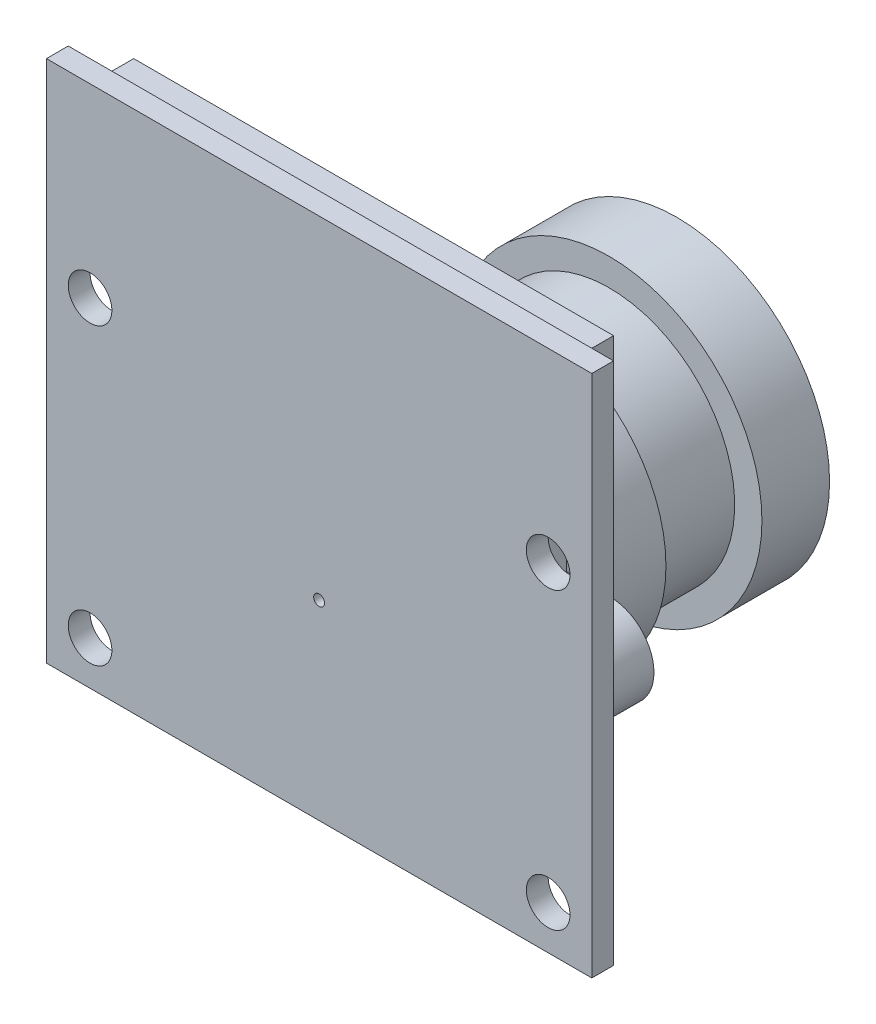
from build123d import *

# Parameters (mm, degrees)
SKETCH_1_W             = 25
SKETCH_1_H             = 24
EXTRUDE_337_DEPTH      = 1
EXTRUDE_519_DEPTH      = 3.8
SKETCH_3_W             = 22
SKETCH_3_H             = 4.802295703
EXTRUDE_786_DEPTH      = 1.5
HOLE_WIZARD_954_D      = 0.5
HOLE_WIZARD_954_DEPTH  = 1
HOLE_WIZARD_1616_D     = 2
HOLE_WIZARD_1616_DEPTH = 16.4


with BuildPart() as part:
    # Sketch 1 → Extrude 337 (new body)
    with BuildSketch(Plane(origin=(0, 0, -1), x_dir=(-1, 0, 0), z_dir=(0, 0, -1))):
        with Locations((-12.5, 12)):
            Rectangle(SKETCH_1_W, SKETCH_1_H)
    extrude(amount=-EXTRUDE_337_DEPTH)

    # Sketch 2 → Extrude 519 (add)
    with BuildSketch(Plane(origin=(0, 0, -1), x_dir=(-1, 0, 0), z_dir=(0, 0, -1))):
        with BuildLine():
            Line((-5.95, 10.75), (-3.949995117, 10.75))
            ThreePointArc((-3.949995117, 10.75), (-1.949995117, 8.75), (-3.949995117, 6.75))
            Line((-3.949995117, 6.75), (-5.95, 6.75))
            Line((-5.95, 6.75), (-5.95, 2.2))
            Line((-5.95, 2.2), (-19.05, 2.2))
            Line((-19.05, 2.2), (-19.05, 6.75))
            Line((-19.05, 6.75), (-21.050009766, 6.75))
            ThreePointArc((-21.050009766, 6.75), (-23.050009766, 8.75), (-21.050009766, 10.75))
            Line((-21.050009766, 10.75), (-19.05, 10.75))
            Line((-19.05, 10.75), (-19.05, 15.3))
            Line((-19.05, 15.3), (-5.95, 15.3))
            Line((-5.95, 15.3), (-5.95, 10.75))
        make_face()
    extrude(amount=EXTRUDE_519_DEPTH)

    # Sketch 3 → Extrude 786 (add)
    with BuildSketch(Plane(origin=(0, 0, -1), x_dir=(-1, 0, 0), z_dir=(0, 0, -1))):
        with Locations((-12.5, 21.098852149)):
            Rectangle(SKETCH_3_W, SKETCH_3_H)
    extrude(amount=EXTRUDE_786_DEPTH)

    # Sketch 4 → Revolve 895 (revolve)
    with BuildSketch(Plane.XZ.offset(-8.75), mode=Mode.PRIVATE) as revolve_895_sk:
        Polygon((19.1, -4.8), (12.5, -4.8), (12.5, -16.4), (19.5, -16.4), (19.5, -13.3), (18.25, -13.3), (18.25, -9.3), (19.1, -9.3), align=None)
    revolve(revolve_895_sk.sketch.rotate(Axis((12.5, 8.75, -4.8), (0, 0, -1)), 180), axis=Axis((12.5, 8.75, -4.8), (0, 0, -1)))

    # Hole Wizard 954
    with Locations(Plane.XY):
        with Locations((12.5, 8.75)):
            Hole(HOLE_WIZARD_954_D / 2, depth=HOLE_WIZARD_954_DEPTH)

    # Hole Wizard 1616
    with Locations(Plane.XY):
        with Locations((2, 2), (2, 15.5), (23, 15.5), (23, 2)):
            Hole(HOLE_WIZARD_1616_D / 2, depth=HOLE_WIZARD_1616_DEPTH)


solid = part.part
